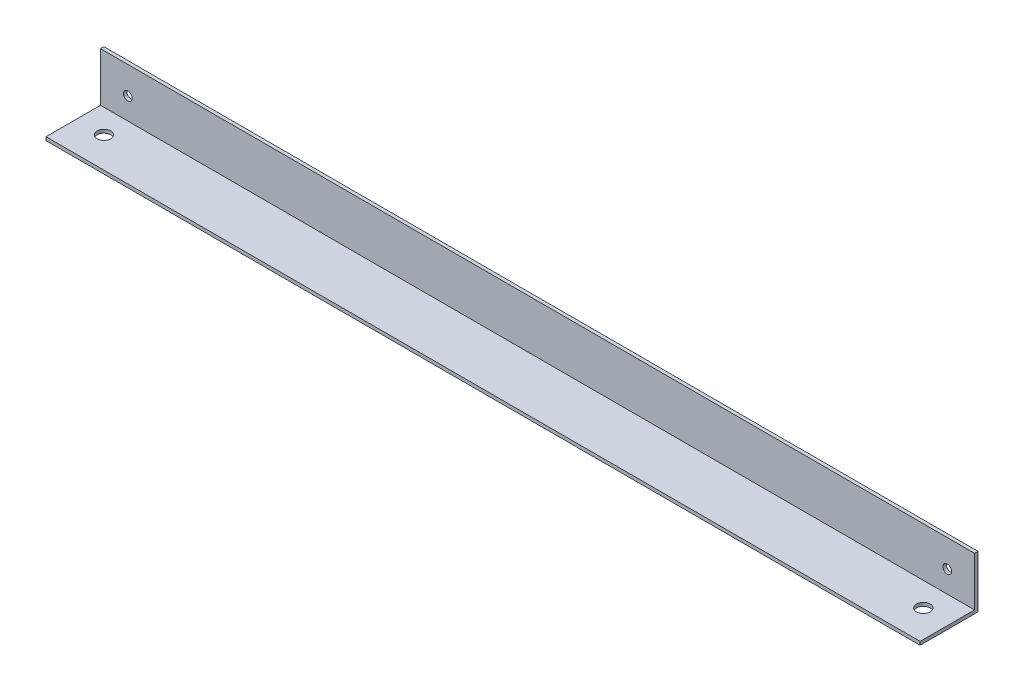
ISO-10303-21;
HEADER;
FILE_DESCRIPTION(('STEP AP214'),'2;1');
FILE_NAME('part.step','',(''),(''),'','','');
FILE_SCHEMA(('AUTOMOTIVE_DESIGN { 1 0 10303 214 1 1 1 1 }'));
ENDSEC;
DATA;
#1=APPLICATION_CONTEXT('core data for automotive mechanical design processes');
#2=APPLICATION_PROTOCOL_DEFINITION('international standard','automotive_design',2000,#1);
#3=PRODUCT_CONTEXT('',#1,'mechanical');
#4=PRODUCT('Part','Part','',(#3));
#5=PRODUCT_RELATED_PRODUCT_CATEGORY('part','',(#4));
#6=PRODUCT_DEFINITION_FORMATION('','',#4);
#7=PRODUCT_DEFINITION_CONTEXT('part definition',#1,'design');
#8=PRODUCT_DEFINITION('design','',#6,#7);
#9=PRODUCT_DEFINITION_SHAPE('','',#8);
#10=(LENGTH_UNIT() NAMED_UNIT(*) SI_UNIT(.MILLI.,.METRE.));
#11=(NAMED_UNIT(*) PLANE_ANGLE_UNIT() SI_UNIT($,.RADIAN.));
#12=(NAMED_UNIT(*) SI_UNIT($,.STERADIAN.) SOLID_ANGLE_UNIT());
#13=UNCERTAINTY_MEASURE_WITH_UNIT(LENGTH_MEASURE(1.E-05),#10,'distance_accuracy_value','');
#14=(GEOMETRIC_REPRESENTATION_CONTEXT(3) GLOBAL_UNCERTAINTY_ASSIGNED_CONTEXT((#13)) GLOBAL_UNIT_ASSIGNED_CONTEXT((#10,
#11,#12)) REPRESENTATION_CONTEXT('',''));
#15=CARTESIAN_POINT('',(0.,0.,0.));
#16=DIRECTION('',(0.,0.,1.));
#17=DIRECTION('',(1.,0.,0.));
#18=AXIS2_PLACEMENT_3D('',#15,#16,#17);
#19=CARTESIAN_POINT('',(0.,0.,26.924));
#20=DIRECTION('',(0.,0.,1.));
#21=DIRECTION('',(1.,0.,0.));
#22=AXIS2_PLACEMENT_3D('',#19,#20,#21);
#23=PLANE('',#22);
#24=DIRECTION('',(1.,0.,0.));
#25=VECTOR('',#24,1.);
#26=CARTESIAN_POINT('',(-209.826086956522,45.0420093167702,26.924));
#27=LINE('',#26,#25);
#28=CARTESIAN_POINT('',(-209.826086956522,45.0420093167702,26.924));
#29=VERTEX_POINT('',#28);
#30=CARTESIAN_POINT('',(196.573913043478,45.0420093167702,26.924));
#31=VERTEX_POINT('',#30);
#32=EDGE_CURVE('E118',#29,#31,#27,.T.);
#33=ORIENTED_EDGE('',*,*,#32,.F.);
#34=DIRECTION('',(0.,-1.,0.));
#35=VECTOR('',#34,1.);
#36=CARTESIAN_POINT('',(-209.826086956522,67.8385093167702,26.924));
#37=LINE('',#36,#35);
#38=CARTESIAN_POINT('',(-209.826086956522,43.4545093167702,26.924));
#39=VERTEX_POINT('',#38);
#40=EDGE_CURVE('E96',#29,#39,#37,.T.);
#41=ORIENTED_EDGE('',*,*,#40,.T.);
#42=DIRECTION('',(1.,0.,0.));
#43=VECTOR('',#42,1.);
#44=CARTESIAN_POINT('',(-209.826086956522,43.4545093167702,26.924));
#45=LINE('',#44,#43);
#46=CARTESIAN_POINT('',(196.573913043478,43.4545093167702,26.924));
#47=VERTEX_POINT('',#46);
#48=EDGE_CURVE('E58',#39,#47,#45,.T.);
#49=ORIENTED_EDGE('',*,*,#48,.T.);
#50=DIRECTION('',(0.,1.,0.));
#51=VECTOR('',#50,1.);
#52=CARTESIAN_POINT('',(196.573913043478,67.8385093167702,26.924));
#53=LINE('',#52,#51);
#54=EDGE_CURVE('E89',#47,#31,#53,.T.);
#55=ORIENTED_EDGE('',*,*,#54,.T.);
#56=EDGE_LOOP('',(#33,#41,#49,#55));
#57=FACE_BOUND('',#56,.T.);
#58=ADVANCED_FACE('F39',(#57),#23,.T.);
#59=CARTESIAN_POINT('',(-209.826086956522,67.8385093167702,26.924));
#60=DIRECTION('',(1.,0.,0.));
#61=DIRECTION('',(0.,0.,-1.));
#62=AXIS2_PLACEMENT_3D('',#59,#60,#61);
#63=PLANE('',#62);
#64=DIRECTION('',(0.,0.,1.));
#65=VECTOR('',#64,1.);
#66=CARTESIAN_POINT('',(-209.826086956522,45.0420093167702,-404.93789811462));
#67=LINE('',#66,#65);
#68=CARTESIAN_POINT('',(-209.826086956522,45.0420093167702,1.58750000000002));
#69=VERTEX_POINT('',#68);
#70=EDGE_CURVE('E146',#69,#29,#67,.T.);
#71=ORIENTED_EDGE('',*,*,#70,.F.);
#72=DIRECTION('',(0.,1.,0.));
#73=VECTOR('',#72,1.);
#74=CARTESIAN_POINT('',(-209.826086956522,55.1385093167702,1.5875));
#75=LINE('',#74,#73);
#76=CARTESIAN_POINT('',(-209.826086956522,67.8385093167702,1.5875));
#77=VERTEX_POINT('',#76);
#78=EDGE_CURVE('E88',#69,#77,#75,.T.);
#79=ORIENTED_EDGE('',*,*,#78,.T.);
#80=DIRECTION('',(0.,0.,-1.));
#81=VECTOR('',#80,1.);
#82=CARTESIAN_POINT('',(-209.826086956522,67.8385093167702,26.924));
#83=LINE('',#82,#81);
#84=CARTESIAN_POINT('',(-209.826086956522,67.8385093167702,0.));
#85=VERTEX_POINT('',#84);
#86=EDGE_CURVE('E82',#77,#85,#83,.T.);
#87=ORIENTED_EDGE('',*,*,#86,.T.);
#88=DIRECTION('',(0.,-1.,0.));
#89=VECTOR('',#88,1.);
#90=CARTESIAN_POINT('',(-209.826086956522,67.8385093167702,0.));
#91=LINE('',#90,#89);
#92=CARTESIAN_POINT('',(-209.826086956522,43.4545093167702,0.));
#93=VERTEX_POINT('',#92);
#94=EDGE_CURVE('E86',#85,#93,#91,.T.);
#95=ORIENTED_EDGE('',*,*,#94,.T.);
#96=DIRECTION('',(0.,0.,-1.));
#97=VECTOR('',#96,1.);
#98=CARTESIAN_POINT('',(-209.826086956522,43.4545093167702,26.924));
#99=LINE('',#98,#97);
#100=EDGE_CURVE('E11',#39,#93,#99,.T.);
#101=ORIENTED_EDGE('',*,*,#100,.F.);
#102=ORIENTED_EDGE('',*,*,#40,.F.);
#103=EDGE_LOOP('',(#71,#79,#87,#95,#101,#102));
#104=FACE_BOUND('',#103,.T.);
#105=ADVANCED_FACE('F41',(#104),#63,.F.);
#106=CARTESIAN_POINT('',(-209.826086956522,43.4545093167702,26.924));
#107=DIRECTION('',(0.,1.,0.));
#108=DIRECTION('',(0.,0.,1.));
#109=AXIS2_PLACEMENT_3D('',#106,#107,#108);
#110=PLANE('',#109);
#111=CARTESIAN_POINT('',(-197.126086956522,43.4545093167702,12.7));
#112=DIRECTION('',(0.,-1.,0.));
#113=DIRECTION('',(0.,0.,-1.));
#114=AXIS2_PLACEMENT_3D('',#111,#112,#113);
#115=CIRCLE('',#114,3.175);
#116=CARTESIAN_POINT('',(-197.126086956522,43.4545093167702,9.525));
#117=VERTEX_POINT('',#116);
#118=EDGE_CURVE('E116',#117,#117,#115,.T.);
#119=ORIENTED_EDGE('',*,*,#118,.F.);
#120=EDGE_LOOP('',(#119));
#121=FACE_BOUND('',#120,.T.);
#122=CARTESIAN_POINT('',(183.873913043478,43.4545093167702,12.7));
#123=DIRECTION('',(0.,-1.,0.));
#124=DIRECTION('',(0.,0.,1.));
#125=AXIS2_PLACEMENT_3D('',#122,#123,#124);
#126=CIRCLE('',#125,3.175);
#127=CARTESIAN_POINT('',(183.873913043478,43.4545093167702,15.875));
#128=VERTEX_POINT('',#127);
#129=EDGE_CURVE('E125',#128,#128,#126,.T.);
#130=ORIENTED_EDGE('',*,*,#129,.F.);
#131=EDGE_LOOP('',(#130));
#132=FACE_BOUND('',#131,.T.);
#133=DIRECTION('',(1.,0.,0.));
#134=VECTOR('',#133,1.);
#135=CARTESIAN_POINT('',(-209.826086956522,43.4545093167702,0.));
#136=LINE('',#135,#134);
#137=CARTESIAN_POINT('',(196.573913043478,43.4545093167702,0.));
#138=VERTEX_POINT('',#137);
#139=EDGE_CURVE('E100',#93,#138,#136,.T.);
#140=ORIENTED_EDGE('',*,*,#139,.T.);
#141=DIRECTION('',(0.,0.,-1.));
#142=VECTOR('',#141,1.);
#143=CARTESIAN_POINT('',(196.573913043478,43.4545093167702,26.924));
#144=LINE('',#143,#142);
#145=EDGE_CURVE('E49',#47,#138,#144,.T.);
#146=ORIENTED_EDGE('',*,*,#145,.F.);
#147=ORIENTED_EDGE('',*,*,#48,.F.);
#148=ORIENTED_EDGE('',*,*,#100,.T.);
#149=EDGE_LOOP('',(#140,#146,#147,#148));
#150=FACE_BOUND('',#149,.T.);
#151=ADVANCED_FACE('F177',(#121,#132,#150),#110,.F.);
#152=CARTESIAN_POINT('',(196.573913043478,67.8385093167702,26.924));
#153=DIRECTION('',(-1.,0.,0.));
#154=DIRECTION('',(0.,0.,1.));
#155=AXIS2_PLACEMENT_3D('',#152,#153,#154);
#156=PLANE('',#155);
#157=DIRECTION('',(0.,1.,0.));
#158=VECTOR('',#157,1.);
#159=CARTESIAN_POINT('',(196.573913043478,55.1385093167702,1.5875));
#160=LINE('',#159,#158);
#161=CARTESIAN_POINT('',(196.573913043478,45.0420093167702,1.58750000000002));
#162=VERTEX_POINT('',#161);
#163=CARTESIAN_POINT('',(196.573913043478,67.8385093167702,1.5875));
#164=VERTEX_POINT('',#163);
#165=EDGE_CURVE('E103',#162,#164,#160,.T.);
#166=ORIENTED_EDGE('',*,*,#165,.F.);
#167=DIRECTION('',(0.,0.,1.));
#168=VECTOR('',#167,1.);
#169=CARTESIAN_POINT('',(196.573913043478,45.0420093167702,-404.93789811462));
#170=LINE('',#169,#168);
#171=EDGE_CURVE('E143',#162,#31,#170,.T.);
#172=ORIENTED_EDGE('',*,*,#171,.T.);
#173=ORIENTED_EDGE('',*,*,#54,.F.);
#174=ORIENTED_EDGE('',*,*,#145,.T.);
#175=DIRECTION('',(0.,1.,0.));
#176=VECTOR('',#175,1.);
#177=CARTESIAN_POINT('',(196.573913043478,67.8385093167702,0.));
#178=LINE('',#177,#176);
#179=CARTESIAN_POINT('',(196.573913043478,67.8385093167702,0.));
#180=VERTEX_POINT('',#179);
#181=EDGE_CURVE('E97',#138,#180,#178,.T.);
#182=ORIENTED_EDGE('',*,*,#181,.T.);
#183=DIRECTION('',(0.,0.,-1.));
#184=VECTOR('',#183,1.);
#185=CARTESIAN_POINT('',(196.573913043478,67.8385093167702,26.924));
#186=LINE('',#185,#184);
#187=EDGE_CURVE('E75',#164,#180,#186,.T.);
#188=ORIENTED_EDGE('',*,*,#187,.F.);
#189=EDGE_LOOP('',(#166,#172,#173,#174,#182,#188));
#190=FACE_BOUND('',#189,.T.);
#191=ADVANCED_FACE('F163',(#190),#156,.F.);
#192=CARTESIAN_POINT('',(-209.826086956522,67.8385093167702,26.924));
#193=DIRECTION('',(0.,-1.,0.));
#194=DIRECTION('',(0.,0.,-1.));
#195=AXIS2_PLACEMENT_3D('',#192,#193,#194);
#196=PLANE('',#195);
#197=ORIENTED_EDGE('',*,*,#86,.F.);
#198=DIRECTION('',(-1.,0.,0.));
#199=VECTOR('',#198,1.);
#200=CARTESIAN_POINT('',(-209.826086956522,67.8385093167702,1.5875));
#201=LINE('',#200,#199);
#202=EDGE_CURVE('E149',#164,#77,#201,.T.);
#203=ORIENTED_EDGE('',*,*,#202,.F.);
#204=ORIENTED_EDGE('',*,*,#187,.T.);
#205=DIRECTION('',(-1.,0.,0.));
#206=VECTOR('',#205,1.);
#207=CARTESIAN_POINT('',(-209.826086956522,67.8385093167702,0.));
#208=LINE('',#207,#206);
#209=EDGE_CURVE('E92',#180,#85,#208,.T.);
#210=ORIENTED_EDGE('',*,*,#209,.T.);
#211=EDGE_LOOP('',(#197,#203,#204,#210));
#212=FACE_BOUND('',#211,.T.);
#213=ADVANCED_FACE('F93',(#212),#196,.F.);
#214=CARTESIAN_POINT('',(0.,0.,0.));
#215=DIRECTION('',(0.,0.,1.));
#216=DIRECTION('',(1.,0.,0.));
#217=AXIS2_PLACEMENT_3D('',#214,#215,#216);
#218=PLANE('',#217);
#219=CARTESIAN_POINT('',(183.873913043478,55.1385093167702,0.));
#220=DIRECTION('',(0.,0.,-1.));
#221=DIRECTION('',(-1.,0.,0.));
#222=AXIS2_PLACEMENT_3D('',#219,#220,#221);
#223=CIRCLE('',#222,2.03200000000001);
#224=CARTESIAN_POINT('',(181.841913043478,55.1385093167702,0.));
#225=VERTEX_POINT('',#224);
#226=EDGE_CURVE('E121',#225,#225,#223,.T.);
#227=ORIENTED_EDGE('',*,*,#226,.F.);
#228=EDGE_LOOP('',(#227));
#229=FACE_BOUND('',#228,.T.);
#230=CARTESIAN_POINT('',(-197.126086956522,55.1385093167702,0.));
#231=DIRECTION('',(0.,0.,-1.));
#232=DIRECTION('',(1.,0.,0.));
#233=AXIS2_PLACEMENT_3D('',#230,#231,#232);
#234=CIRCLE('',#233,2.03200000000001);
#235=CARTESIAN_POINT('',(-195.094086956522,55.1385093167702,0.));
#236=VERTEX_POINT('',#235);
#237=EDGE_CURVE('E127',#236,#236,#234,.T.);
#238=ORIENTED_EDGE('',*,*,#237,.F.);
#239=EDGE_LOOP('',(#238));
#240=FACE_BOUND('',#239,.T.);
#241=ORIENTED_EDGE('',*,*,#94,.F.);
#242=ORIENTED_EDGE('',*,*,#209,.F.);
#243=ORIENTED_EDGE('',*,*,#181,.F.);
#244=ORIENTED_EDGE('',*,*,#139,.F.);
#245=EDGE_LOOP('',(#241,#242,#243,#244));
#246=FACE_BOUND('',#245,.T.);
#247=ADVANCED_FACE('F99',(#229,#240,#246),#218,.F.);
#248=CARTESIAN_POINT('',(-209.826086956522,55.1385093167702,1.5875));
#249=DIRECTION('',(0.,0.,-1.));
#250=DIRECTION('',(-1.,0.,0.));
#251=AXIS2_PLACEMENT_3D('',#248,#249,#250);
#252=PLANE('',#251);
#253=CARTESIAN_POINT('',(183.873913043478,55.1385093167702,1.5875));
#254=DIRECTION('',(0.,0.,-1.));
#255=DIRECTION('',(-1.,0.,0.));
#256=AXIS2_PLACEMENT_3D('',#253,#254,#255);
#257=CIRCLE('',#256,2.03200000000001);
#258=CARTESIAN_POINT('',(181.841913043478,55.1385093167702,1.5875));
#259=VERTEX_POINT('',#258);
#260=EDGE_CURVE('E43',#259,#259,#257,.T.);
#261=ORIENTED_EDGE('',*,*,#260,.T.);
#262=EDGE_LOOP('',(#261));
#263=FACE_BOUND('',#262,.T.);
#264=CARTESIAN_POINT('',(-197.126086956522,55.1385093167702,1.5875));
#265=DIRECTION('',(0.,0.,-1.));
#266=DIRECTION('',(-1.,0.,0.));
#267=AXIS2_PLACEMENT_3D('',#264,#265,#266);
#268=CIRCLE('',#267,2.03200000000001);
#269=CARTESIAN_POINT('',(-199.158086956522,55.1385093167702,1.5875));
#270=VERTEX_POINT('',#269);
#271=EDGE_CURVE('E119',#270,#270,#268,.T.);
#272=ORIENTED_EDGE('',*,*,#271,.T.);
#273=EDGE_LOOP('',(#272));
#274=FACE_BOUND('',#273,.T.);
#275=ORIENTED_EDGE('',*,*,#202,.T.);
#276=ORIENTED_EDGE('',*,*,#78,.F.);
#277=DIRECTION('',(1.,0.,0.));
#278=VECTOR('',#277,1.);
#279=CARTESIAN_POINT('',(-209.826086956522,45.0420093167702,1.58750000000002));
#280=LINE('',#279,#278);
#281=EDGE_CURVE('E140',#69,#162,#280,.T.);
#282=ORIENTED_EDGE('',*,*,#281,.T.);
#283=ORIENTED_EDGE('',*,*,#165,.T.);
#284=EDGE_LOOP('',(#275,#276,#282,#283));
#285=FACE_BOUND('',#284,.T.);
#286=ADVANCED_FACE('F171',(#263,#274,#285),#252,.F.);
#287=CARTESIAN_POINT('',(-209.826086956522,45.0420093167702,-404.93789811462));
#288=DIRECTION('',(0.,-1.,0.));
#289=DIRECTION('',(0.,0.,-1.));
#290=AXIS2_PLACEMENT_3D('',#287,#288,#289);
#291=PLANE('',#290);
#292=CARTESIAN_POINT('',(-197.126086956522,45.0420093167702,12.7));
#293=DIRECTION('',(0.,-1.,0.));
#294=DIRECTION('',(0.,0.,-1.));
#295=AXIS2_PLACEMENT_3D('',#292,#293,#294);
#296=CIRCLE('',#295,3.175);
#297=CARTESIAN_POINT('',(-197.126086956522,45.0420093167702,9.525));
#298=VERTEX_POINT('',#297);
#299=EDGE_CURVE('E115',#298,#298,#296,.T.);
#300=ORIENTED_EDGE('',*,*,#299,.T.);
#301=EDGE_LOOP('',(#300));
#302=FACE_BOUND('',#301,.T.);
#303=CARTESIAN_POINT('',(183.873913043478,45.0420093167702,12.7));
#304=DIRECTION('',(0.,-1.,0.));
#305=DIRECTION('',(0.,0.,-1.));
#306=AXIS2_PLACEMENT_3D('',#303,#304,#305);
#307=CIRCLE('',#306,3.175);
#308=CARTESIAN_POINT('',(183.873913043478,45.0420093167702,9.52500000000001));
#309=VERTEX_POINT('',#308);
#310=EDGE_CURVE('E112',#309,#309,#307,.T.);
#311=ORIENTED_EDGE('',*,*,#310,.T.);
#312=EDGE_LOOP('',(#311));
#313=FACE_BOUND('',#312,.T.);
#314=ORIENTED_EDGE('',*,*,#70,.T.);
#315=ORIENTED_EDGE('',*,*,#32,.T.);
#316=ORIENTED_EDGE('',*,*,#171,.F.);
#317=ORIENTED_EDGE('',*,*,#281,.F.);
#318=EDGE_LOOP('',(#314,#315,#316,#317));
#319=FACE_BOUND('',#318,.T.);
#320=ADVANCED_FACE('F168',(#302,#313,#319),#291,.F.);
#321=CARTESIAN_POINT('',(183.873913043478,45.9945093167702,12.7));
#322=DIRECTION('',(0.,-1.,0.));
#323=DIRECTION('',(0.,0.,-1.));
#324=AXIS2_PLACEMENT_3D('',#321,#322,#323);
#325=CYLINDRICAL_SURFACE('',#324,3.175);
#326=ORIENTED_EDGE('',*,*,#129,.T.);
#327=EDGE_LOOP('',(#326));
#328=FACE_BOUND('',#327,.T.);
#329=ORIENTED_EDGE('',*,*,#310,.F.);
#330=EDGE_LOOP('',(#329));
#331=FACE_BOUND('',#330,.T.);
#332=ADVANCED_FACE('F228',(#328,#331),#325,.F.);
#333=CARTESIAN_POINT('',(-197.126086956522,45.9945093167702,12.7));
#334=DIRECTION('',(0.,-1.,0.));
#335=DIRECTION('',(0.,0.,-1.));
#336=AXIS2_PLACEMENT_3D('',#333,#334,#335);
#337=CYLINDRICAL_SURFACE('',#336,3.175);
#338=ORIENTED_EDGE('',*,*,#118,.T.);
#339=EDGE_LOOP('',(#338));
#340=FACE_BOUND('',#339,.T.);
#341=ORIENTED_EDGE('',*,*,#299,.F.);
#342=EDGE_LOOP('',(#341));
#343=FACE_BOUND('',#342,.T.);
#344=ADVANCED_FACE('F238',(#340,#343),#337,.F.);
#345=CARTESIAN_POINT('',(-197.126086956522,55.1385093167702,2.54));
#346=DIRECTION('',(0.,0.,-1.));
#347=DIRECTION('',(-1.,0.,0.));
#348=AXIS2_PLACEMENT_3D('',#345,#346,#347);
#349=CYLINDRICAL_SURFACE('',#348,2.03200000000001);
#350=ORIENTED_EDGE('',*,*,#237,.T.);
#351=EDGE_LOOP('',(#350));
#352=FACE_BOUND('',#351,.T.);
#353=ORIENTED_EDGE('',*,*,#271,.F.);
#354=EDGE_LOOP('',(#353));
#355=FACE_BOUND('',#354,.T.);
#356=ADVANCED_FACE('F244',(#352,#355),#349,.F.);
#357=CARTESIAN_POINT('',(183.873913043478,55.1385093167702,2.54));
#358=DIRECTION('',(0.,0.,-1.));
#359=DIRECTION('',(-1.,0.,0.));
#360=AXIS2_PLACEMENT_3D('',#357,#358,#359);
#361=CYLINDRICAL_SURFACE('',#360,2.03200000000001);
#362=ORIENTED_EDGE('',*,*,#226,.T.);
#363=EDGE_LOOP('',(#362));
#364=FACE_BOUND('',#363,.T.);
#365=ORIENTED_EDGE('',*,*,#260,.F.);
#366=EDGE_LOOP('',(#365));
#367=FACE_BOUND('',#366,.T.);
#368=ADVANCED_FACE('F251',(#364,#367),#361,.F.);
#369=CLOSED_SHELL('',(#58,#105,#151,#191,#213,#247,#286,#320,#332,#344,#356,#368));
#370=MANIFOLD_SOLID_BREP('B2',#369);
#371=ADVANCED_BREP_SHAPE_REPRESENTATION('',(#18,#370),#14);
#372=SHAPE_DEFINITION_REPRESENTATION(#9,#371);
ENDSEC;
END-ISO-10303-21;
